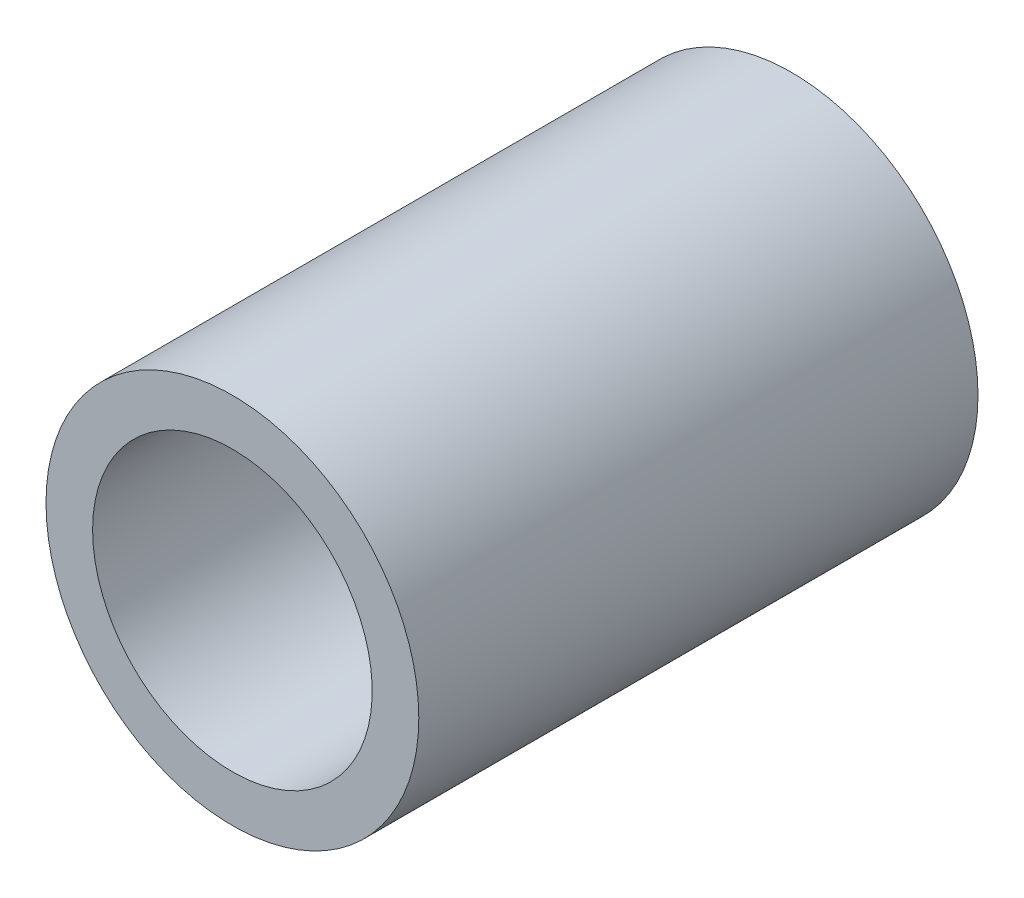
ISO-10303-21;
HEADER;
FILE_DESCRIPTION(('STEP AP214'),'2;1');
FILE_NAME('part.step','',(''),(''),'','','');
FILE_SCHEMA(('AUTOMOTIVE_DESIGN { 1 0 10303 214 1 1 1 1 }'));
ENDSEC;
DATA;
#1=APPLICATION_CONTEXT('core data for automotive mechanical design processes');
#2=APPLICATION_PROTOCOL_DEFINITION('international standard','automotive_design',2000,#1);
#3=PRODUCT_CONTEXT('',#1,'mechanical');
#4=PRODUCT('Part','Part','',(#3));
#5=PRODUCT_RELATED_PRODUCT_CATEGORY('part','',(#4));
#6=PRODUCT_DEFINITION_FORMATION('','',#4);
#7=PRODUCT_DEFINITION_CONTEXT('part definition',#1,'design');
#8=PRODUCT_DEFINITION('design','',#6,#7);
#9=PRODUCT_DEFINITION_SHAPE('','',#8);
#10=(LENGTH_UNIT() NAMED_UNIT(*) SI_UNIT(.MILLI.,.METRE.));
#11=(NAMED_UNIT(*) PLANE_ANGLE_UNIT() SI_UNIT($,.RADIAN.));
#12=(NAMED_UNIT(*) SI_UNIT($,.STERADIAN.) SOLID_ANGLE_UNIT());
#13=UNCERTAINTY_MEASURE_WITH_UNIT(LENGTH_MEASURE(1.E-05),#10,'distance_accuracy_value','');
#14=(GEOMETRIC_REPRESENTATION_CONTEXT(3) GLOBAL_UNCERTAINTY_ASSIGNED_CONTEXT((#13)) GLOBAL_UNIT_ASSIGNED_CONTEXT((#10,
#11,#12)) REPRESENTATION_CONTEXT('',''));
#15=CARTESIAN_POINT('',(0.,0.,0.));
#16=DIRECTION('',(0.,0.,1.));
#17=DIRECTION('',(1.,0.,0.));
#18=AXIS2_PLACEMENT_3D('',#15,#16,#17);
#19=CARTESIAN_POINT('',(0.,0.,60.));
#20=DIRECTION('',(0.,0.,0.999999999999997));
#21=DIRECTION('',(0.999999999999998,0.,0.));
#22=AXIS2_PLACEMENT_3D('',#19,#20,#21);
#23=PLANE('',#22);
#24=CARTESIAN_POINT('',(0.,0.,60.));
#25=DIRECTION('',(0.,0.,0.999999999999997));
#26=DIRECTION('',(0.999999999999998,0.,0.));
#27=AXIS2_PLACEMENT_3D('',#24,#25,#26);
#28=CIRCLE('',#27,20.);
#29=CARTESIAN_POINT('',(-20.,0.,60.));
#30=VERTEX_POINT('',#29);
#31=EDGE_CURVE('E13',#30,#30,#28,.T.);
#32=ORIENTED_EDGE('',*,*,#31,.T.);
#33=EDGE_LOOP('',(#32));
#34=FACE_BOUND('',#33,.T.);
#35=CARTESIAN_POINT('',(0.,0.,60.));
#36=DIRECTION('',(0.,0.,0.999999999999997));
#37=DIRECTION('',(0.999999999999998,0.,0.));
#38=AXIS2_PLACEMENT_3D('',#35,#36,#37);
#39=CIRCLE('',#38,15.);
#40=CARTESIAN_POINT('',(-15.,0.,60.));
#41=VERTEX_POINT('',#40);
#42=EDGE_CURVE('E64',#41,#41,#39,.T.);
#43=ORIENTED_EDGE('',*,*,#42,.F.);
#44=EDGE_LOOP('',(#43));
#45=FACE_BOUND('',#44,.T.);
#46=ADVANCED_FACE('F53',(#34,#45),#23,.T.);
#47=CARTESIAN_POINT('',(0.,0.,0.));
#48=DIRECTION('',(0.,0.,0.999999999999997));
#49=DIRECTION('',(0.999999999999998,0.,0.));
#50=AXIS2_PLACEMENT_3D('',#47,#48,#49);
#51=PLANE('',#50);
#52=CARTESIAN_POINT('',(0.,0.,0.));
#53=DIRECTION('',(0.,0.,0.999999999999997));
#54=DIRECTION('',(0.999999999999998,0.,0.));
#55=AXIS2_PLACEMENT_3D('',#52,#53,#54);
#56=CIRCLE('',#55,20.);
#57=CARTESIAN_POINT('',(-20.,0.,0.));
#58=VERTEX_POINT('',#57);
#59=EDGE_CURVE('E60',#58,#58,#56,.T.);
#60=ORIENTED_EDGE('',*,*,#59,.F.);
#61=EDGE_LOOP('',(#60));
#62=FACE_BOUND('',#61,.T.);
#63=CARTESIAN_POINT('',(0.,0.,0.));
#64=DIRECTION('',(0.,0.,0.999999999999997));
#65=DIRECTION('',(0.999999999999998,0.,0.));
#66=AXIS2_PLACEMENT_3D('',#63,#64,#65);
#67=CIRCLE('',#66,15.);
#68=CARTESIAN_POINT('',(-15.,0.,0.));
#69=VERTEX_POINT('',#68);
#70=EDGE_CURVE('E68',#69,#69,#67,.T.);
#71=ORIENTED_EDGE('',*,*,#70,.T.);
#72=EDGE_LOOP('',(#71));
#73=FACE_BOUND('',#72,.T.);
#74=ADVANCED_FACE('F74',(#62,#73),#51,.F.);
#75=CARTESIAN_POINT('',(0.,0.,60.));
#76=DIRECTION('',(0.,0.,-0.999999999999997));
#77=DIRECTION('',(-0.999999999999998,0.,0.));
#78=AXIS2_PLACEMENT_3D('',#75,#76,#77);
#79=CYLINDRICAL_SURFACE('',#78,20.);
#80=CARTESIAN_POINT('',(-20.,0.,60.));
#81=CARTESIAN_POINT('',(-20.,0.,59.375));
#82=CARTESIAN_POINT('',(-20.,0.,58.75));
#83=CARTESIAN_POINT('',(-20.,0.,57.5));
#84=CARTESIAN_POINT('',(-20.,0.,56.875));
#85=CARTESIAN_POINT('',(-20.,0.,55.625));
#86=CARTESIAN_POINT('',(-20.,0.,55.));
#87=CARTESIAN_POINT('',(-20.,0.,53.75));
#88=CARTESIAN_POINT('',(-20.,0.,53.125));
#89=CARTESIAN_POINT('',(-20.,0.,51.875));
#90=CARTESIAN_POINT('',(-20.,0.,51.25));
#91=CARTESIAN_POINT('',(-20.,0.,50.));
#92=CARTESIAN_POINT('',(-20.,0.,49.375));
#93=CARTESIAN_POINT('',(-20.,0.,48.125));
#94=CARTESIAN_POINT('',(-20.,0.,47.5));
#95=CARTESIAN_POINT('',(-20.,0.,46.25));
#96=CARTESIAN_POINT('',(-20.,0.,45.625));
#97=CARTESIAN_POINT('',(-20.,0.,44.375));
#98=CARTESIAN_POINT('',(-20.,0.,43.75));
#99=CARTESIAN_POINT('',(-20.,0.,42.5));
#100=CARTESIAN_POINT('',(-20.,0.,41.875));
#101=CARTESIAN_POINT('',(-20.,0.,40.625));
#102=CARTESIAN_POINT('',(-20.,0.,40.));
#103=CARTESIAN_POINT('',(-20.,0.,38.75));
#104=CARTESIAN_POINT('',(-20.,0.,38.125));
#105=CARTESIAN_POINT('',(-20.,0.,36.875));
#106=CARTESIAN_POINT('',(-20.,0.,36.25));
#107=CARTESIAN_POINT('',(-20.,0.,35.));
#108=CARTESIAN_POINT('',(-20.,0.,34.375));
#109=CARTESIAN_POINT('',(-20.,0.,33.125));
#110=CARTESIAN_POINT('',(-20.,0.,32.5));
#111=CARTESIAN_POINT('',(-20.,0.,31.25));
#112=CARTESIAN_POINT('',(-20.,0.,30.625));
#113=CARTESIAN_POINT('',(-20.,0.,29.375));
#114=CARTESIAN_POINT('',(-20.,0.,28.75));
#115=CARTESIAN_POINT('',(-20.,0.,27.5));
#116=CARTESIAN_POINT('',(-20.,0.,26.875));
#117=CARTESIAN_POINT('',(-20.,0.,25.625));
#118=CARTESIAN_POINT('',(-20.,0.,25.));
#119=CARTESIAN_POINT('',(-20.,0.,23.75));
#120=CARTESIAN_POINT('',(-20.,0.,23.125));
#121=CARTESIAN_POINT('',(-20.,0.,21.875));
#122=CARTESIAN_POINT('',(-20.,0.,21.25));
#123=CARTESIAN_POINT('',(-20.,0.,20.));
#124=CARTESIAN_POINT('',(-20.,0.,19.375));
#125=CARTESIAN_POINT('',(-20.,0.,18.125));
#126=CARTESIAN_POINT('',(-20.,0.,17.5));
#127=CARTESIAN_POINT('',(-20.,0.,16.25));
#128=CARTESIAN_POINT('',(-20.,0.,15.625));
#129=CARTESIAN_POINT('',(-20.,0.,14.375));
#130=CARTESIAN_POINT('',(-20.,0.,13.75));
#131=CARTESIAN_POINT('',(-20.,0.,12.5));
#132=CARTESIAN_POINT('',(-20.,0.,11.875));
#133=CARTESIAN_POINT('',(-20.,0.,10.625));
#134=CARTESIAN_POINT('',(-20.,0.,9.99999999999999));
#135=CARTESIAN_POINT('',(-20.,0.,8.74999999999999));
#136=CARTESIAN_POINT('',(-20.,0.,8.12499999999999));
#137=CARTESIAN_POINT('',(-20.,0.,6.87499999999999));
#138=CARTESIAN_POINT('',(-20.,0.,6.24999999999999));
#139=CARTESIAN_POINT('',(-20.,0.,4.99999999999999));
#140=CARTESIAN_POINT('',(-20.,0.,4.37499999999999));
#141=CARTESIAN_POINT('',(-20.,0.,3.12499999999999));
#142=CARTESIAN_POINT('',(-20.,0.,2.49999999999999));
#143=CARTESIAN_POINT('',(-20.,0.,1.24999999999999));
#144=CARTESIAN_POINT('',(-20.,0.,0.624999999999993));
#145=CARTESIAN_POINT('',(-20.,0.,0.));
#146=B_SPLINE_CURVE_WITH_KNOTS('',3,(#80,#81,#82,#83,#84,#85,#86,#87,#88,#89,#90,#91,#92,#93,
#94,#95,#96,#97,#98,#99,#100,#101,#102,#103,#104,#105,#106,#107,#108,#109,#110,#111,#112,#113,
#114,#115,#116,#117,#118,#119,#120,#121,#122,#123,#124,#125,#126,#127,#128,#129,#130,#131,#132,
#133,#134,#135,#136,#137,#138,#139,#140,#141,#142,#143,#144,#145),.UNSPECIFIED.,.F.,.F.,(4,2,2,
2,2,2,2,2,2,2,2,2,2,2,2,2,2,2,2,2,2,2,2,2,2,2,2,2,2,2,2,2,4),(0.,1.875,3.75,5.62500000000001,
7.50000000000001,9.375,11.25,13.125,15.,16.875,18.75,20.625,22.5,24.375,26.25,28.125,30.,31.875,
33.75,35.625,37.5,39.375,41.25,43.125,45.,46.875,48.75,50.625,52.5,54.375,56.25,58.125,60.),.UNSPECIFIED.);
#147=EDGE_CURVE('BSEAM55',#30,#58,#146,.T.);
#148=ORIENTED_EDGE('',*,*,#31,.F.);
#149=ORIENTED_EDGE('',*,*,#59,.T.);
#150=ORIENTED_EDGE('',*,*,#147,.T.);
#151=ORIENTED_EDGE('',*,*,#147,.F.);
#152=EDGE_LOOP('',(#148,#150,#149,#151));
#153=FACE_BOUND('',#152,.T.);
#154=ADVANCED_FACE('F55',(#153),#79,.T.);
#155=CARTESIAN_POINT('',(0.,0.,60.));
#156=DIRECTION('',(0.,0.,-0.999999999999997));
#157=DIRECTION('',(-0.999999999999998,0.,0.));
#158=AXIS2_PLACEMENT_3D('',#155,#156,#157);
#159=CYLINDRICAL_SURFACE('',#158,15.);
#160=CARTESIAN_POINT('',(-15.,0.,60.));
#161=CARTESIAN_POINT('',(-15.,0.,59.375));
#162=CARTESIAN_POINT('',(-15.,0.,58.75));
#163=CARTESIAN_POINT('',(-15.,0.,57.5));
#164=CARTESIAN_POINT('',(-15.,0.,56.875));
#165=CARTESIAN_POINT('',(-15.,0.,55.625));
#166=CARTESIAN_POINT('',(-15.,0.,55.));
#167=CARTESIAN_POINT('',(-15.,0.,53.75));
#168=CARTESIAN_POINT('',(-15.,0.,53.125));
#169=CARTESIAN_POINT('',(-15.,0.,51.875));
#170=CARTESIAN_POINT('',(-15.,0.,51.25));
#171=CARTESIAN_POINT('',(-15.,0.,50.));
#172=CARTESIAN_POINT('',(-15.,0.,49.375));
#173=CARTESIAN_POINT('',(-15.,0.,48.125));
#174=CARTESIAN_POINT('',(-15.,0.,47.5));
#175=CARTESIAN_POINT('',(-15.,0.,46.25));
#176=CARTESIAN_POINT('',(-15.,0.,45.625));
#177=CARTESIAN_POINT('',(-15.,0.,44.375));
#178=CARTESIAN_POINT('',(-15.,0.,43.75));
#179=CARTESIAN_POINT('',(-15.,0.,42.5));
#180=CARTESIAN_POINT('',(-15.,0.,41.875));
#181=CARTESIAN_POINT('',(-15.,0.,40.625));
#182=CARTESIAN_POINT('',(-15.,0.,40.));
#183=CARTESIAN_POINT('',(-15.,0.,38.75));
#184=CARTESIAN_POINT('',(-15.,0.,38.125));
#185=CARTESIAN_POINT('',(-15.,0.,36.875));
#186=CARTESIAN_POINT('',(-15.,0.,36.25));
#187=CARTESIAN_POINT('',(-15.,0.,35.));
#188=CARTESIAN_POINT('',(-15.,0.,34.375));
#189=CARTESIAN_POINT('',(-15.,0.,33.125));
#190=CARTESIAN_POINT('',(-15.,0.,32.5));
#191=CARTESIAN_POINT('',(-15.,0.,31.25));
#192=CARTESIAN_POINT('',(-15.,0.,30.625));
#193=CARTESIAN_POINT('',(-15.,0.,29.375));
#194=CARTESIAN_POINT('',(-15.,0.,28.75));
#195=CARTESIAN_POINT('',(-15.,0.,27.5));
#196=CARTESIAN_POINT('',(-15.,0.,26.875));
#197=CARTESIAN_POINT('',(-15.,0.,25.625));
#198=CARTESIAN_POINT('',(-15.,0.,25.));
#199=CARTESIAN_POINT('',(-15.,0.,23.75));
#200=CARTESIAN_POINT('',(-15.,0.,23.125));
#201=CARTESIAN_POINT('',(-15.,0.,21.875));
#202=CARTESIAN_POINT('',(-15.,0.,21.25));
#203=CARTESIAN_POINT('',(-15.,0.,20.));
#204=CARTESIAN_POINT('',(-15.,0.,19.375));
#205=CARTESIAN_POINT('',(-15.,0.,18.125));
#206=CARTESIAN_POINT('',(-15.,0.,17.5));
#207=CARTESIAN_POINT('',(-15.,0.,16.25));
#208=CARTESIAN_POINT('',(-15.,0.,15.625));
#209=CARTESIAN_POINT('',(-15.,0.,14.375));
#210=CARTESIAN_POINT('',(-15.,0.,13.75));
#211=CARTESIAN_POINT('',(-15.,0.,12.5));
#212=CARTESIAN_POINT('',(-15.,0.,11.875));
#213=CARTESIAN_POINT('',(-15.,0.,10.625));
#214=CARTESIAN_POINT('',(-15.,0.,9.99999999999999));
#215=CARTESIAN_POINT('',(-15.,0.,8.74999999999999));
#216=CARTESIAN_POINT('',(-15.,0.,8.12499999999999));
#217=CARTESIAN_POINT('',(-15.,0.,6.87499999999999));
#218=CARTESIAN_POINT('',(-15.,0.,6.24999999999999));
#219=CARTESIAN_POINT('',(-15.,0.,4.99999999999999));
#220=CARTESIAN_POINT('',(-15.,0.,4.37499999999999));
#221=CARTESIAN_POINT('',(-15.,0.,3.12499999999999));
#222=CARTESIAN_POINT('',(-15.,0.,2.49999999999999));
#223=CARTESIAN_POINT('',(-15.,0.,1.24999999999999));
#224=CARTESIAN_POINT('',(-15.,0.,0.624999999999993));
#225=CARTESIAN_POINT('',(-15.,0.,0.));
#226=B_SPLINE_CURVE_WITH_KNOTS('',3,(#160,#161,#162,#163,#164,#165,#166,#167,#168,#169,#170,
#171,#172,#173,#174,#175,#176,#177,#178,#179,#180,#181,#182,#183,#184,#185,#186,#187,#188,#189,
#190,#191,#192,#193,#194,#195,#196,#197,#198,#199,#200,#201,#202,#203,#204,#205,#206,#207,#208,
#209,#210,#211,#212,#213,#214,#215,#216,#217,#218,#219,#220,#221,#222,#223,#224,#225),
.UNSPECIFIED.,.F.,.F.,(4,2,2,2,2,2,2,2,2,2,2,2,2,2,2,2,2,2,2,2,2,2,2,2,2,2,2,2,2,2,2,2,4),(0.,
1.875,3.75,5.62500000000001,7.50000000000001,9.375,11.25,13.125,15.,16.875,18.75,20.625,22.5,
24.375,26.25,28.125,30.,31.875,33.75,35.625,37.5,39.375,41.25,43.125,45.,46.875,48.75,50.625,
52.5,54.375,56.25,58.125,60.),.UNSPECIFIED.);
#227=EDGE_CURVE('BSEAM76',#41,#69,#226,.T.);
#228=ORIENTED_EDGE('',*,*,#42,.T.);
#229=ORIENTED_EDGE('',*,*,#70,.F.);
#230=ORIENTED_EDGE('',*,*,#227,.T.);
#231=ORIENTED_EDGE('',*,*,#227,.F.);
#232=EDGE_LOOP('',(#228,#230,#229,#231));
#233=FACE_BOUND('',#232,.T.);
#234=ADVANCED_FACE('F76',(#233),#159,.F.);
#235=CLOSED_SHELL('',(#46,#74,#154,#234));
#236=MANIFOLD_SOLID_BREP('B2',#235);
#237=ADVANCED_BREP_SHAPE_REPRESENTATION('',(#18,#236),#14);
#238=SHAPE_DEFINITION_REPRESENTATION(#9,#237);
ENDSEC;
END-ISO-10303-21;
